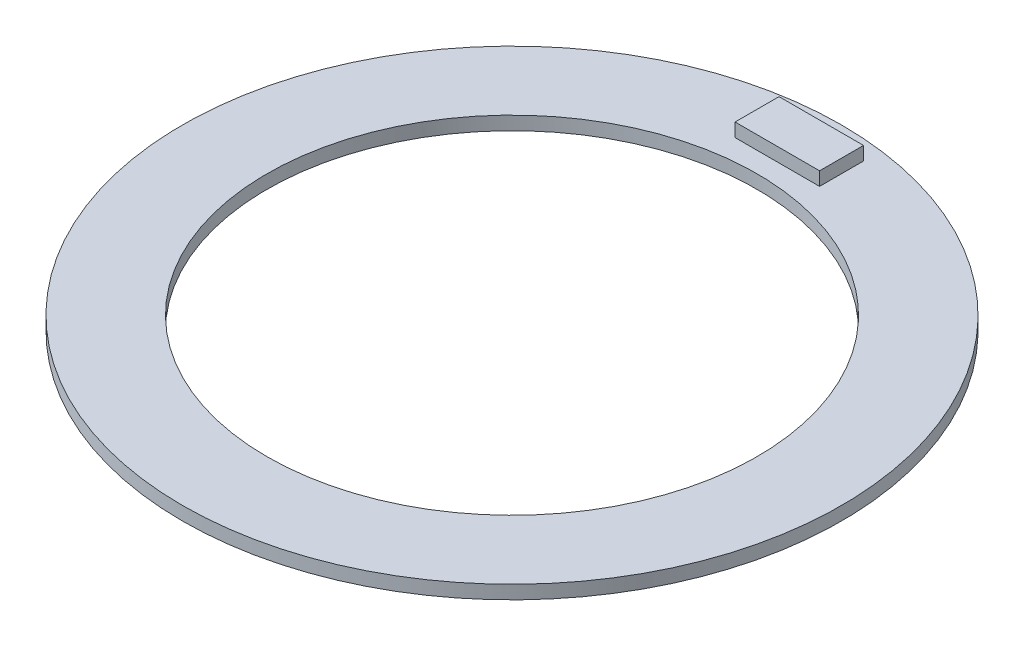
from build123d import *

# Parameters (mm, degrees)
SKETCH1_R           = 24.765
SKETCH1_R_2         = 18.415
BOSS_EXTRUDE1_DEPTH = 1.016
SKETCH2_W           = 6.35
SKETCH2_H           = 3.302
BOSS_EXTRUDE2_DEPTH = 1.016


with BuildPart() as part:
    # Sketch1 → Boss-Extrude1 (new body)
    with BuildSketch(Plane(origin=(0, 0, 0), x_dir=(1, 0, 0), z_dir=(0, 1, 0))):
        with Locations(Location((0, 0, 0), (0, 0, 270))):
            Circle(SKETCH1_R)
        with Locations(Location((0, 0, 0), (0, 0, 270))):
            Circle(SKETCH1_R_2, mode=Mode.SUBTRACT)
    extrude(amount=BOSS_EXTRUDE1_DEPTH)


with BuildPart() as body_2:
    # Sketch2 → Boss-Extrude2 (new body)
    with BuildSketch(Plane(origin=(0, 1.016, 0), x_dir=(1, 0, 0), z_dir=(0, 1, 0))):
        with Locations((0, 21.59)):
            Rectangle(SKETCH2_W, SKETCH2_H)
    extrude(amount=BOSS_EXTRUDE2_DEPTH)


solid = Compound([part.part, body_2.part])
